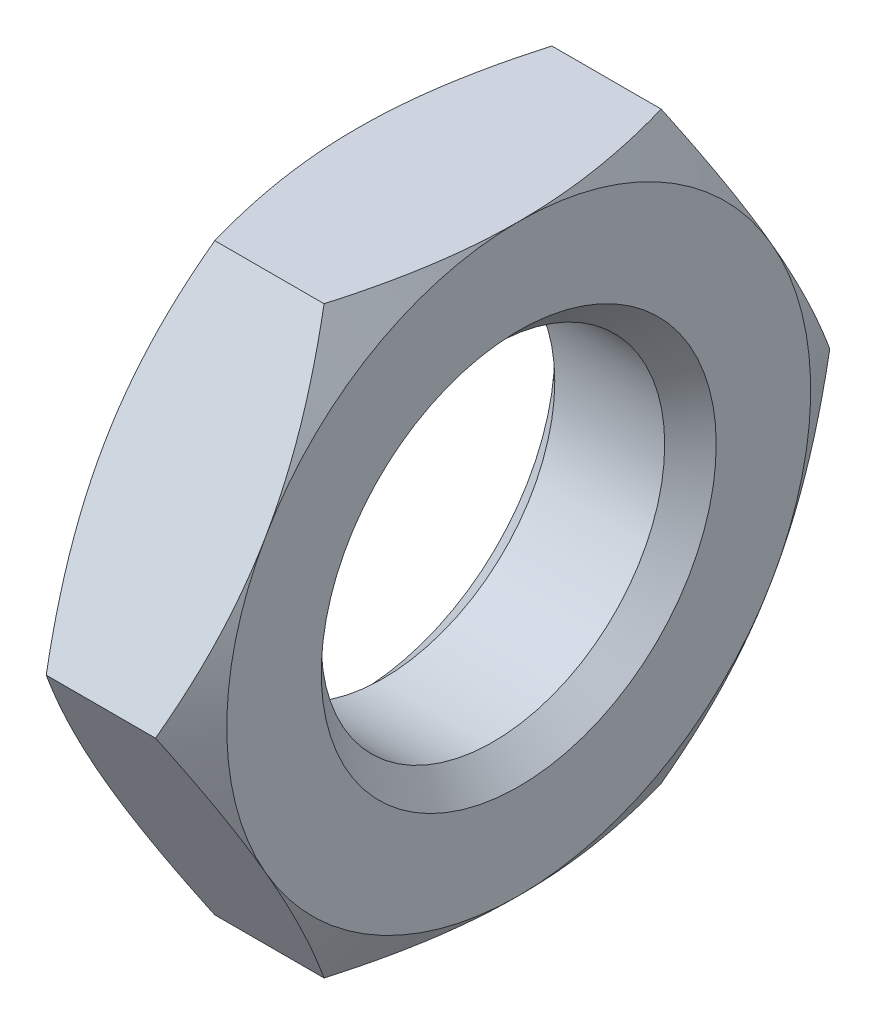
ISO-10303-21;
HEADER;
FILE_DESCRIPTION(('STEP AP214'),'2;1');
FILE_NAME('part.step','',(''),(''),'','','');
FILE_SCHEMA(('AUTOMOTIVE_DESIGN { 1 0 10303 214 1 1 1 1 }'));
ENDSEC;
DATA;
#1=APPLICATION_CONTEXT('core data for automotive mechanical design processes');
#2=APPLICATION_PROTOCOL_DEFINITION('international standard','automotive_design',2000,#1);
#3=PRODUCT_CONTEXT('',#1,'mechanical');
#4=PRODUCT('Part','Part','',(#3));
#5=PRODUCT_RELATED_PRODUCT_CATEGORY('part','',(#4));
#6=PRODUCT_DEFINITION_FORMATION('','',#4);
#7=PRODUCT_DEFINITION_CONTEXT('part definition',#1,'design');
#8=PRODUCT_DEFINITION('design','',#6,#7);
#9=PRODUCT_DEFINITION_SHAPE('','',#8);
#10=(LENGTH_UNIT() NAMED_UNIT(*) SI_UNIT(.MILLI.,.METRE.));
#11=(NAMED_UNIT(*) PLANE_ANGLE_UNIT() SI_UNIT($,.RADIAN.));
#12=(NAMED_UNIT(*) SI_UNIT($,.STERADIAN.) SOLID_ANGLE_UNIT());
#13=UNCERTAINTY_MEASURE_WITH_UNIT(LENGTH_MEASURE(1.E-05),#10,'distance_accuracy_value','');
#14=(GEOMETRIC_REPRESENTATION_CONTEXT(3) GLOBAL_UNCERTAINTY_ASSIGNED_CONTEXT((#13)) GLOBAL_UNIT_ASSIGNED_CONTEXT((#10,
#11,#12)) REPRESENTATION_CONTEXT('',''));
#15=CARTESIAN_POINT('',(0.,0.,0.));
#16=DIRECTION('',(0.,0.,1.));
#17=DIRECTION('',(1.,0.,0.));
#18=AXIS2_PLACEMENT_3D('',#15,#16,#17);
#19=CARTESIAN_POINT('',(4.7,8.5,-4.90747728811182));
#20=DIRECTION('',(1.,0.,0.));
#21=DIRECTION('',(0.,0.,-1.));
#22=AXIS2_PLACEMENT_3D('',#19,#20,#21);
#23=PLANE('',#22);
#24=CARTESIAN_POINT('',(4.7,0.,0.));
#25=DIRECTION('',(1.,0.,0.));
#26=DIRECTION('',(0.,0.,-1.));
#27=AXIS2_PLACEMENT_3D('',#24,#25,#26);
#28=CIRCLE('',#27,5.75000000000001);
#29=CARTESIAN_POINT('',(4.7,0.,-5.75000000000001));
#30=VERTEX_POINT('',#29);
#31=EDGE_CURVE('E11',#30,#30,#28,.F.);
#32=ORIENTED_EDGE('',*,*,#31,.T.);
#33=EDGE_LOOP('',(#32));
#34=FACE_BOUND('',#33,.T.);
#35=CARTESIAN_POINT('',(4.7,0.,0.));
#36=DIRECTION('',(1.,0.,0.));
#37=DIRECTION('',(0.,0.,-1.));
#38=AXIS2_PLACEMENT_3D('',#35,#36,#37);
#39=CIRCLE('',#38,8.5);
#40=CARTESIAN_POINT('',(4.7,-8.5,0.));
#41=VERTEX_POINT('',#40);
#42=CARTESIAN_POINT('',(4.7,-4.25,-7.36121593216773));
#43=VERTEX_POINT('',#42);
#44=EDGE_CURVE('E142',#41,#43,#39,.T.);
#45=ORIENTED_EDGE('',*,*,#44,.T.);
#46=CARTESIAN_POINT('',(4.7,4.25,-7.36121593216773));
#47=VERTEX_POINT('',#46);
#48=EDGE_CURVE('E130',#43,#47,#39,.T.);
#49=ORIENTED_EDGE('',*,*,#48,.T.);
#50=CARTESIAN_POINT('',(4.7,8.5,0.));
#51=VERTEX_POINT('',#50);
#52=EDGE_CURVE('E144',#47,#51,#39,.T.);
#53=ORIENTED_EDGE('',*,*,#52,.T.);
#54=CARTESIAN_POINT('',(4.7,4.25,7.36121593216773));
#55=VERTEX_POINT('',#54);
#56=EDGE_CURVE('E55',#51,#55,#39,.T.);
#57=ORIENTED_EDGE('',*,*,#56,.T.);
#58=CARTESIAN_POINT('',(4.7,-4.25,7.36121593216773));
#59=VERTEX_POINT('',#58);
#60=EDGE_CURVE('E63',#55,#59,#39,.T.);
#61=ORIENTED_EDGE('',*,*,#60,.T.);
#62=EDGE_CURVE('E166',#59,#41,#39,.T.);
#63=ORIENTED_EDGE('',*,*,#62,.T.);
#64=EDGE_LOOP('',(#45,#49,#53,#57,#61,#63));
#65=FACE_BOUND('',#64,.T.);
#66=ADVANCED_FACE('F39',(#34,#65),#23,.T.);
#67=CARTESIAN_POINT('',(0.,8.5,-4.90747728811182));
#68=DIRECTION('',(1.,0.,0.));
#69=DIRECTION('',(0.,0.,-1.));
#70=AXIS2_PLACEMENT_3D('',#67,#68,#69);
#71=PLANE('',#70);
#72=CARTESIAN_POINT('',(0.,0.,0.));
#73=DIRECTION('',(1.,0.,0.));
#74=DIRECTION('',(0.,0.,-1.));
#75=AXIS2_PLACEMENT_3D('',#72,#73,#74);
#76=CIRCLE('',#75,5.75);
#77=CARTESIAN_POINT('',(0.,0.,-5.75));
#78=VERTEX_POINT('',#77);
#79=EDGE_CURVE('E164',#78,#78,#76,.T.);
#80=ORIENTED_EDGE('',*,*,#79,.T.);
#81=EDGE_LOOP('',(#80));
#82=FACE_BOUND('',#81,.T.);
#83=CARTESIAN_POINT('',(0.,0.,0.));
#84=DIRECTION('',(1.,0.,0.));
#85=DIRECTION('',(0.,0.,-1.));
#86=AXIS2_PLACEMENT_3D('',#83,#84,#85);
#87=CIRCLE('',#86,8.5);
#88=CARTESIAN_POINT('',(0.,-4.25,-7.36121593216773));
#89=VERTEX_POINT('',#88);
#90=CARTESIAN_POINT('',(0.,4.25,-7.36121593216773));
#91=VERTEX_POINT('',#90);
#92=EDGE_CURVE('E173',#89,#91,#87,.T.);
#93=ORIENTED_EDGE('',*,*,#92,.F.);
#94=CARTESIAN_POINT('',(0.,-8.5,0.));
#95=VERTEX_POINT('',#94);
#96=EDGE_CURVE('E318',#95,#89,#87,.T.);
#97=ORIENTED_EDGE('',*,*,#96,.F.);
#98=CARTESIAN_POINT('',(0.,-4.25,7.36121593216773));
#99=VERTEX_POINT('',#98);
#100=EDGE_CURVE('E321',#99,#95,#87,.T.);
#101=ORIENTED_EDGE('',*,*,#100,.F.);
#102=CARTESIAN_POINT('',(0.,4.25,7.36121593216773));
#103=VERTEX_POINT('',#102);
#104=EDGE_CURVE('E328',#103,#99,#87,.T.);
#105=ORIENTED_EDGE('',*,*,#104,.F.);
#106=CARTESIAN_POINT('',(0.,8.5,0.));
#107=VERTEX_POINT('',#106);
#108=EDGE_CURVE('E178',#107,#103,#87,.T.);
#109=ORIENTED_EDGE('',*,*,#108,.F.);
#110=EDGE_CURVE('E174',#91,#107,#87,.T.);
#111=ORIENTED_EDGE('',*,*,#110,.F.);
#112=EDGE_LOOP('',(#93,#97,#101,#105,#109,#111));
#113=FACE_BOUND('',#112,.T.);
#114=ADVANCED_FACE('F319',(#82,#113),#71,.F.);
#115=CARTESIAN_POINT('',(4.7,0.,0.));
#116=DIRECTION('',(-1.,0.,0.));
#117=DIRECTION('',(0.,0.,1.));
#118=AXIS2_PLACEMENT_3D('',#115,#116,#117);
#119=CYLINDRICAL_SURFACE('',#118,5.);
#120=CARTESIAN_POINT('',(0.750000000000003,0.,0.));
#121=DIRECTION('',(1.,0.,0.));
#122=DIRECTION('',(0.,0.,-1.));
#123=AXIS2_PLACEMENT_3D('',#120,#121,#122);
#124=CIRCLE('',#123,5.);
#125=CARTESIAN_POINT('',(0.750000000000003,0.,-5.));
#126=VERTEX_POINT('',#125);
#127=EDGE_CURVE('E48',#126,#126,#124,.F.);
#128=ORIENTED_EDGE('',*,*,#127,.T.);
#129=EDGE_LOOP('',(#128));
#130=FACE_BOUND('',#129,.T.);
#131=CARTESIAN_POINT('',(3.95,0.,0.));
#132=DIRECTION('',(1.,0.,0.));
#133=DIRECTION('',(0.,0.,-1.));
#134=AXIS2_PLACEMENT_3D('',#131,#132,#133);
#135=CIRCLE('',#134,5.);
#136=CARTESIAN_POINT('',(3.95,0.,-5.));
#137=VERTEX_POINT('',#136);
#138=EDGE_CURVE('E391',#137,#137,#135,.T.);
#139=ORIENTED_EDGE('',*,*,#138,.T.);
#140=EDGE_LOOP('',(#139));
#141=FACE_BOUND('',#140,.T.);
#142=ADVANCED_FACE('F234',(#130,#141),#119,.F.);
#143=CARTESIAN_POINT('',(0.,0.,0.));
#144=DIRECTION('',(1.,0.,0.));
#145=DIRECTION('',(0.,0.,-1.));
#146=AXIS2_PLACEMENT_3D('',#143,#144,#145);
#147=CONICAL_SURFACE('',#146,8.5,1.0471975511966);
#148=CARTESIAN_POINT('',(0.759256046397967,-8.5002,-4.90736181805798));
#149=CARTESIAN_POINT('',(0.696986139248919,-8.31336077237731,-5.01523349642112));
#150=CARTESIAN_POINT('',(0.637542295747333,-8.1258249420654,-5.1235073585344));
#151=CARTESIAN_POINT('',(0.52508511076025,-7.74923024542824,-5.34093440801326));
#152=CARTESIAN_POINT('',(0.472074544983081,-7.56017075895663,-5.45008795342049));
#153=CARTESIAN_POINT('',(0.323733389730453,-6.9899652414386,-5.77929626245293));
#154=CARTESIAN_POINT('',(0.239358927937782,-6.60656835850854,-6.00065055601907));
#155=CARTESIAN_POINT('',(0.140420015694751,-6.03282233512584,-6.33190297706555));
#156=CARTESIAN_POINT('',(0.112235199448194,-5.84418723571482,-6.44081150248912));
#157=CARTESIAN_POINT('',(0.0649740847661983,-5.46606397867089,-6.65912106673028));
#158=CARTESIAN_POINT('',(0.0458969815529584,-5.27657589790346,-6.76852206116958));
#159=CARTESIAN_POINT('',(0.0173347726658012,-4.8972734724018,-6.98751241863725));
#160=CARTESIAN_POINT('',(0.00783878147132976,-4.70745974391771,-7.09710142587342));
#161=CARTESIAN_POINT('',(-0.0013576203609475,-4.32765694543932,-7.3163806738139));
#162=CARTESIAN_POINT('',(-0.00105833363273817,-4.13766788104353,-7.42607091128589));
#163=CARTESIAN_POINT('',(0.00865447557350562,-3.78247698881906,-7.63114046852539));
#164=CARTESIAN_POINT('',(0.0168831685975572,-3.6172500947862,-7.72653426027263));
#165=CARTESIAN_POINT('',(0.0405892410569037,-3.28718328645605,-7.9170984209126));
#166=CARTESIAN_POINT('',(0.0560671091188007,-3.12234339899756,-8.01226877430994));
#167=CARTESIAN_POINT('',(0.11300862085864,-2.62846189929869,-8.29741139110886));
#168=CARTESIAN_POINT('',(0.164973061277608,-2.30029449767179,-8.48687892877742));
#169=CARTESIAN_POINT('',(0.294884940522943,-1.64047857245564,-8.86782383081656));
#170=CARTESIAN_POINT('',(0.373383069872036,-1.30891425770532,-9.05925257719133));
#171=CARTESIAN_POINT('',(0.551541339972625,-0.650730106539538,-9.43925537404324));
#172=CARTESIAN_POINT('',(0.651159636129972,-0.324101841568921,-9.62783429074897));
#173=CARTESIAN_POINT('',(0.759256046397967,0.000199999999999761,-9.81507004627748));
#174=B_SPLINE_CURVE_WITH_KNOTS('',3,(#148,#149,#150,#151,#152,#153,#154,#155,#156,#157,#158,
#159,#160,#161,#162,#163,#164,#165,#166,#167,#168,#169,#170,#171,#172,#173),.UNSPECIFIED.,.F.,
.F.,(4,2,2,2,2,2,2,2,2,2,2,2,4),(0.,0.673596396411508,1.34748239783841,2.69805431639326,
3.356799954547,4.01548737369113,4.67342558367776,5.33134346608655,5.90409556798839,
6.47688628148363,7.62328361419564,8.79510569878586,9.9646274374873),.UNSPECIFIED.);
#175=CARTESIAN_POINT('',(0.759189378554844,0.,-9.81495457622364));
#176=VERTEX_POINT('',#175);
#177=EDGE_CURVE('E336',#89,#176,#174,.T.);
#178=ORIENTED_EDGE('',*,*,#177,.F.);
#179=ORIENTED_EDGE('',*,*,#92,.T.);
#180=CARTESIAN_POINT('',(0.759256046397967,-0.00020000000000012,-9.81507004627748));
#181=CARTESIAN_POINT('',(0.69698613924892,0.186639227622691,-9.70719836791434));
#182=CARTESIAN_POINT('',(0.637542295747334,0.374175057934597,-9.59892450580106));
#183=CARTESIAN_POINT('',(0.52508511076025,0.750769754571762,-9.3814974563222));
#184=CARTESIAN_POINT('',(0.472074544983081,0.939829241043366,-9.27234391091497));
#185=CARTESIAN_POINT('',(0.323733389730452,1.5100347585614,-8.94313560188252));
#186=CARTESIAN_POINT('',(0.23935892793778,1.89343164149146,-8.72178130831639));
#187=CARTESIAN_POINT('',(0.14042001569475,2.46717766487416,-8.39052888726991));
#188=CARTESIAN_POINT('',(0.112235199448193,2.65581276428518,-8.28162036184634));
#189=CARTESIAN_POINT('',(0.0649740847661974,3.03393602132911,-8.06331079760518));
#190=CARTESIAN_POINT('',(0.0458969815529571,3.22342410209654,-7.95390980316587));
#191=CARTESIAN_POINT('',(0.0173347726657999,3.6027265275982,-7.73491944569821));
#192=CARTESIAN_POINT('',(0.00783878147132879,3.79254025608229,-7.62533043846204));
#193=CARTESIAN_POINT('',(-0.00135762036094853,4.17234305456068,-7.40605119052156));
#194=CARTESIAN_POINT('',(-0.00105833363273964,4.36233211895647,-7.29636095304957));
#195=CARTESIAN_POINT('',(0.00865447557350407,4.71752301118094,-7.09129139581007));
#196=CARTESIAN_POINT('',(0.0168831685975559,4.8827499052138,-6.99589760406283));
#197=CARTESIAN_POINT('',(0.0405892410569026,5.21281671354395,-6.80533344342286));
#198=CARTESIAN_POINT('',(0.0560671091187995,5.37765660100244,-6.71016309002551));
#199=CARTESIAN_POINT('',(0.113008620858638,5.87153810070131,-6.42502047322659));
#200=CARTESIAN_POINT('',(0.164973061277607,6.19970550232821,-6.23555293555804));
#201=CARTESIAN_POINT('',(0.294884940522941,6.85952142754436,-5.8546080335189));
#202=CARTESIAN_POINT('',(0.373383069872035,7.19108574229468,-5.66317928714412));
#203=CARTESIAN_POINT('',(0.551541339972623,7.84926989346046,-5.28317649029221));
#204=CARTESIAN_POINT('',(0.65115963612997,8.17589815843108,-5.09459757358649));
#205=CARTESIAN_POINT('',(0.759256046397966,8.5002,-4.90736181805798));
#206=B_SPLINE_CURVE_WITH_KNOTS('',3,(#180,#181,#182,#183,#184,#185,#186,#187,#188,#189,#190,
#191,#192,#193,#194,#195,#196,#197,#198,#199,#200,#201,#202,#203,#204,#205),.UNSPECIFIED.,.F.,
.F.,(4,2,2,2,2,2,2,2,2,2,2,2,4),(0.,0.673596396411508,1.34748239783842,2.69805431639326,
3.356799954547,4.01548737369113,4.67342558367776,5.33134346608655,5.90409556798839,
6.47688628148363,7.62328361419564,8.79510569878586,9.9646274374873),.UNSPECIFIED.);
#207=EDGE_CURVE('E215',#176,#91,#206,.T.);
#208=ORIENTED_EDGE('',*,*,#207,.F.);
#209=EDGE_LOOP('',(#178,#179,#208));
#210=FACE_BOUND('',#209,.T.);
#211=ADVANCED_FACE('F194',(#210),#147,.T.);
#212=ORIENTED_EDGE('',*,*,#96,.T.);
#213=CARTESIAN_POINT('',(0.759189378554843,-8.5,-4.90747728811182));
#214=VERTEX_POINT('',#213);
#215=EDGE_CURVE('E156',#214,#89,#174,.T.);
#216=ORIENTED_EDGE('',*,*,#215,.F.);
#217=CARTESIAN_POINT('',(4.17503521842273,-8.5,-13.2372995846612));
#218=CARTESIAN_POINT('',(3.99450182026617,-8.5,-12.8655907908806));
#219=CARTESIAN_POINT('',(3.81568350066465,-8.5,-12.4930346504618));
#220=CARTESIAN_POINT('',(3.46244047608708,-8.5,-11.7457772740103));
#221=CARTESIAN_POINT('',(3.28801645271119,-8.5,-11.3710757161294));
#222=CARTESIAN_POINT('',(2.94365969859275,-8.5,-10.6171728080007));
#223=CARTESIAN_POINT('',(2.7737561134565,-8.5,-10.2379580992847));
#224=CARTESIAN_POINT('',(2.44082821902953,-8.5,-9.476531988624));
#225=CARTESIAN_POINT('',(2.27780358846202,-8.5,-9.09432072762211));
#226=CARTESIAN_POINT('',(1.95525512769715,-8.5,-8.31372661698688));
#227=CARTESIAN_POINT('',(1.79602021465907,-8.5,-7.91522372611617));
#228=CARTESIAN_POINT('',(1.4894686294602,-8.5,-7.11357707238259));
#229=CARTESIAN_POINT('',(1.34215328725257,-8.5,-6.71043279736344));
#230=CARTESIAN_POINT('',(1.06326825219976,-8.5,-5.89959407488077));
#231=CARTESIAN_POINT('',(0.931667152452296,-8.5,-5.49191054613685));
#232=CARTESIAN_POINT('',(0.688395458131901,-8.5,-4.67070989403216));
#233=CARTESIAN_POINT('',(0.576718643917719,-8.5,-4.25719463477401));
#234=CARTESIAN_POINT('',(0.37922515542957,-8.5,-3.42634387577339));
#235=CARTESIAN_POINT('',(0.293265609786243,-8.5,-3.0090432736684));
#236=CARTESIAN_POINT('',(0.187304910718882,-8.5,-2.3792483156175));
#237=CARTESIAN_POINT('',(0.155813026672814,-8.5,-2.16866088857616));
#238=CARTESIAN_POINT('',(0.101105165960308,-8.5,-1.7464206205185));
#239=CARTESIAN_POINT('',(0.07788838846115,-8.5,-1.53476788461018));
#240=CARTESIAN_POINT('',(0.0404873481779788,-8.5,-1.113469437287));
#241=CARTESIAN_POINT('',(0.0261882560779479,-8.5,-0.903833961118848));
#242=CARTESIAN_POINT('',(0.00647089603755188,-8.5,-0.484146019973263));
#243=CARTESIAN_POINT('',(0.0010524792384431,-8.5,-0.274093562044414));
#244=CARTESIAN_POINT('',(-0.000774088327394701,-8.5,0.146052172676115));
#245=CARTESIAN_POINT('',(0.00281776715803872,-8.5,0.356145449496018));
#246=CARTESIAN_POINT('',(0.0189231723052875,-8.5,0.775992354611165));
#247=CARTESIAN_POINT('',(0.0314371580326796,-8.5,0.985745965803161));
#248=CARTESIAN_POINT('',(0.0718333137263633,-8.5,1.48819217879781));
#249=CARTESIAN_POINT('',(0.103856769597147,-8.5,1.78055900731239));
#250=CARTESIAN_POINT('',(0.183503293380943,-8.5,2.36314504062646));
#251=CARTESIAN_POINT('',(0.231128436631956,-8.5,2.65336395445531));
#252=CARTESIAN_POINT('',(0.394883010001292,-8.5,3.52045554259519));
#253=CARTESIAN_POINT('',(0.531862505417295,-8.5,4.09344393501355));
#254=CARTESIAN_POINT('',(0.769682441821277,-8.5,4.95026142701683));
#255=CARTESIAN_POINT('',(0.855458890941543,-8.5,5.23852765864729));
#256=CARTESIAN_POINT('',(1.03599407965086,-8.5,5.81226113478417));
#257=CARTESIAN_POINT('',(1.130752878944,-8.5,6.09772836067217));
#258=CARTESIAN_POINT('',(1.32772636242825,-8.5,6.66595187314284));
#259=CARTESIAN_POINT('',(1.42993863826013,-8.5,6.94870900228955));
#260=CARTESIAN_POINT('',(1.64060919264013,-8.5,7.51187593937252));
#261=CARTESIAN_POINT('',(1.74906739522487,-8.5,7.79228577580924));
#262=CARTESIAN_POINT('',(2.0136213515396,-8.5,8.45773722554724));
#263=CARTESIAN_POINT('',(2.17208939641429,-8.5,8.84183401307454));
#264=CARTESIAN_POINT('',(2.49684442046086,-8.5,9.60671793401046));
#265=CARTESIAN_POINT('',(2.66313189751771,-8.5,9.98750485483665));
#266=CARTESIAN_POINT('',(3.00194830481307,-8.5,10.7463908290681));
#267=CARTESIAN_POINT('',(3.17447868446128,-8.5,11.1244892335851));
#268=CARTESIAN_POINT('',(3.52451168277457,-8.5,11.8783613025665));
#269=CARTESIAN_POINT('',(3.70201419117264,-8.5,12.2541350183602));
#270=CARTESIAN_POINT('',(4.06125625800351,-8.5,13.0041702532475));
#271=CARTESIAN_POINT('',(4.24300037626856,-8.5,13.3784295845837));
#272=CARTESIAN_POINT('',(4.60980783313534,-8.5,14.1253174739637));
#273=CARTESIAN_POINT('',(4.79487118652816,-8.5,14.4979460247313));
#274=CARTESIAN_POINT('',(5.3541015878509,-8.5,15.6136782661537));
#275=CARTESIAN_POINT('',(5.73235875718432,-8.5,16.35473160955));
#276=CARTESIAN_POINT('',(6.46405178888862,-8.5,17.7700610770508));
#277=CARTESIAN_POINT('',(6.81686536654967,-8.5,18.4446603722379));
#278=CARTESIAN_POINT('',(7.52731870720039,-8.5,19.7913428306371));
#279=CARTESIAN_POINT('',(7.88495864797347,-8.5,20.4634258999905));
#280=CARTESIAN_POINT('',(8.60298478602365,-8.5,21.8039058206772));
#281=CARTESIAN_POINT('',(8.96336160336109,-8.5,22.4723077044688));
#282=CARTESIAN_POINT('',(9.68699043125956,-8.5,23.8075047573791));
#283=CARTESIAN_POINT('',(10.0502422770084,-8.5,24.4743000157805));
#284=CARTESIAN_POINT('',(10.4145657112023,-8.5,25.1405052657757));
#285=B_SPLINE_CURVE_WITH_KNOTS('',3,(#217,#218,#219,#220,#221,#222,#223,#224,#225,#226,#227,
#228,#229,#230,#231,#232,#233,#234,#235,#236,#237,#238,#239,#240,#241,#242,#243,#244,#245,#246,
#247,#248,#249,#250,#251,#252,#253,#254,#255,#256,#257,#258,#259,#260,#261,#262,#263,#264,#265,
#266,#267,#268,#269,#270,#271,#272,#273,#274,#275,#276,#277,#278,#279,#280,#281,#282,#283,#284),
.UNSPECIFIED.,.F.,.F.,(4,2,2,2,2,2,2,2,2,2,2,2,2,2,2,2,2,2,2,2,2,2,2,2,2,2,2,2,2,2,2,2,2,4),(0.,
1.23970741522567,2.47960595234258,3.72616226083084,4.97266028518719,6.25992938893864,
7.54734192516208,8.83213673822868,10.116529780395,11.393648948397,12.0322992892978,
12.6708878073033,13.3010738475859,13.9312493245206,14.5614252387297,15.1916319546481,
16.0734809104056,16.9554472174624,18.7203368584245,19.6225326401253,20.524734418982,
21.4266459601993,22.3285465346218,23.5749372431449,24.8214074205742,26.0681688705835,
27.3149026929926,28.5630448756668,29.8111926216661,32.3071447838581,34.5909923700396,
36.8749243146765,39.153006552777,41.4309591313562),.UNSPECIFIED.);
#286=EDGE_CURVE('E177',#95,#214,#285,.F.);
#287=ORIENTED_EDGE('',*,*,#286,.F.);
#288=EDGE_LOOP('',(#212,#216,#287));
#289=FACE_BOUND('',#288,.T.);
#290=ADVANCED_FACE('F353',(#289),#147,.T.);
#291=CARTESIAN_POINT('',(2.35,0.,0.));
#292=DIRECTION('',(-1.,0.,0.));
#293=DIRECTION('',(0.,0.,1.));
#294=AXIS2_PLACEMENT_3D('',#291,#292,#293);
#295=CONICAL_SURFACE('',#294,12.5703193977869,1.0471975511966);
#296=CARTESIAN_POINT('',(3.94074395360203,0.000199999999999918,-9.81507004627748));
#297=CARTESIAN_POINT('',(4.00301386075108,-0.18663922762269,-9.70719836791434));
#298=CARTESIAN_POINT('',(4.06245770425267,-0.374175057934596,-9.59892450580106));
#299=CARTESIAN_POINT('',(4.17491488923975,-0.750769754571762,-9.3814974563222));
#300=CARTESIAN_POINT('',(4.22792545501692,-0.939829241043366,-9.27234391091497));
#301=CARTESIAN_POINT('',(4.37626661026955,-1.5100347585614,-8.94313560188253));
#302=CARTESIAN_POINT('',(4.46064107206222,-1.89343164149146,-8.72178130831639));
#303=CARTESIAN_POINT('',(4.55957998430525,-2.46717766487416,-8.39052888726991));
#304=CARTESIAN_POINT('',(4.58776480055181,-2.65581276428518,-8.28162036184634));
#305=CARTESIAN_POINT('',(4.6350259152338,-3.03393602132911,-8.06331079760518));
#306=CARTESIAN_POINT('',(4.65410301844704,-3.22342410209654,-7.95390980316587));
#307=CARTESIAN_POINT('',(4.6826652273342,-3.6027265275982,-7.73491944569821));
#308=CARTESIAN_POINT('',(4.69216121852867,-3.79254025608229,-7.62533043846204));
#309=CARTESIAN_POINT('',(4.70135762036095,-4.17234305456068,-7.40605119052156));
#310=CARTESIAN_POINT('',(4.70105833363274,-4.36233211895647,-7.29636095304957));
#311=CARTESIAN_POINT('',(4.6913455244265,-4.71752301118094,-7.09129139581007));
#312=CARTESIAN_POINT('',(4.68311683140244,-4.8827499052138,-6.99589760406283));
#313=CARTESIAN_POINT('',(4.6594107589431,-5.21281671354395,-6.80533344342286));
#314=CARTESIAN_POINT('',(4.6439328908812,-5.37765660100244,-6.71016309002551));
#315=CARTESIAN_POINT('',(4.58699137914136,-5.87153810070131,-6.42502047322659));
#316=CARTESIAN_POINT('',(4.53502693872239,-6.19970550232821,-6.23555293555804));
#317=CARTESIAN_POINT('',(4.40511505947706,-6.85952142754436,-5.8546080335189));
#318=CARTESIAN_POINT('',(4.32661693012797,-7.19108574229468,-5.66317928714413));
#319=CARTESIAN_POINT('',(4.14845866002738,-7.84926989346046,-5.28317649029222));
#320=CARTESIAN_POINT('',(4.04884036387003,-8.17589815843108,-5.09459757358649));
#321=CARTESIAN_POINT('',(3.94074395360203,-8.5002,-4.90736181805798));
#322=B_SPLINE_CURVE_WITH_KNOTS('',3,(#296,#297,#298,#299,#300,#301,#302,#303,#304,#305,#306,
#307,#308,#309,#310,#311,#312,#313,#314,#315,#316,#317,#318,#319,#320,#321),.UNSPECIFIED.,.F.,
.F.,(4,2,2,2,2,2,2,2,2,2,2,2,4),(0.,0.673596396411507,1.34748239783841,2.69805431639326,
3.356799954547,4.01548737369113,4.67342558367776,5.33134346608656,5.90409556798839,
6.47688628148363,7.62328361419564,8.79510569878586,9.9646274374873),.UNSPECIFIED.);
#323=CARTESIAN_POINT('',(3.94081062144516,-8.5,-4.90747728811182));
#324=VERTEX_POINT('',#323);
#325=EDGE_CURVE('E147',#43,#324,#322,.T.);
#326=ORIENTED_EDGE('',*,*,#325,.F.);
#327=ORIENTED_EDGE('',*,*,#44,.F.);
#328=CARTESIAN_POINT('',(0.524964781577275,-8.5,-13.2372995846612));
#329=CARTESIAN_POINT('',(0.705498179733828,-8.5,-12.8655907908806));
#330=CARTESIAN_POINT('',(0.884316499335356,-8.5,-12.4930346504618));
#331=CARTESIAN_POINT('',(1.23755952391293,-8.5,-11.7457772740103));
#332=CARTESIAN_POINT('',(1.41198354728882,-8.5,-11.3710757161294));
#333=CARTESIAN_POINT('',(1.75634030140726,-8.5,-10.6171728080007));
#334=CARTESIAN_POINT('',(1.92624388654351,-8.5,-10.2379580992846));
#335=CARTESIAN_POINT('',(2.25917178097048,-8.5,-9.47653198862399));
#336=CARTESIAN_POINT('',(2.42219641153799,-8.5,-9.09432072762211));
#337=CARTESIAN_POINT('',(2.74474487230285,-8.5,-8.31372661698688));
#338=CARTESIAN_POINT('',(2.90397978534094,-8.5,-7.91522372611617));
#339=CARTESIAN_POINT('',(3.2105313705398,-8.5,-7.11357707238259));
#340=CARTESIAN_POINT('',(3.35784671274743,-8.5,-6.71043279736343));
#341=CARTESIAN_POINT('',(3.63673174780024,-8.5,-5.89959407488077));
#342=CARTESIAN_POINT('',(3.7683328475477,-8.5,-5.49191054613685));
#343=CARTESIAN_POINT('',(4.0116045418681,-8.5,-4.67070989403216));
#344=CARTESIAN_POINT('',(4.12328135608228,-8.5,-4.25719463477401));
#345=CARTESIAN_POINT('',(4.32077484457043,-8.5,-3.42634387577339));
#346=CARTESIAN_POINT('',(4.40673439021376,-8.5,-3.0090432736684));
#347=CARTESIAN_POINT('',(4.51269508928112,-8.5,-2.37924831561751));
#348=CARTESIAN_POINT('',(4.54418697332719,-8.5,-2.16866088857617));
#349=CARTESIAN_POINT('',(4.59889483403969,-8.5,-1.7464206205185));
#350=CARTESIAN_POINT('',(4.62211161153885,-8.5,-1.53476788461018));
#351=CARTESIAN_POINT('',(4.65951265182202,-8.5,-1.11346943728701));
#352=CARTESIAN_POINT('',(4.67381174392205,-8.5,-0.903833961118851));
#353=CARTESIAN_POINT('',(4.69352910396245,-8.5,-0.484146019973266));
#354=CARTESIAN_POINT('',(4.69894752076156,-8.5,-0.274093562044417));
#355=CARTESIAN_POINT('',(4.7007740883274,-8.5,0.146052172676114));
#356=CARTESIAN_POINT('',(4.69718223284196,-8.5,0.356145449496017));
#357=CARTESIAN_POINT('',(4.68107682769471,-8.5,0.775992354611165));
#358=CARTESIAN_POINT('',(4.66856284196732,-8.5,0.98574596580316));
#359=CARTESIAN_POINT('',(4.62816668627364,-8.5,1.48819217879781));
#360=CARTESIAN_POINT('',(4.59614323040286,-8.5,1.78055900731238));
#361=CARTESIAN_POINT('',(4.51649670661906,-8.5,2.36314504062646));
#362=CARTESIAN_POINT('',(4.46887156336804,-8.5,2.65336395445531));
#363=CARTESIAN_POINT('',(4.30511698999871,-8.5,3.52045554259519));
#364=CARTESIAN_POINT('',(4.16813749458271,-8.5,4.09344393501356));
#365=CARTESIAN_POINT('',(3.93031755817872,-8.5,4.95026142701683));
#366=CARTESIAN_POINT('',(3.84454110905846,-8.5,5.2385276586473));
#367=CARTESIAN_POINT('',(3.66400592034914,-8.5,5.81226113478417));
#368=CARTESIAN_POINT('',(3.569247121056,-8.5,6.09772836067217));
#369=CARTESIAN_POINT('',(3.37227363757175,-8.5,6.66595187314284));
#370=CARTESIAN_POINT('',(3.27006136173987,-8.5,6.94870900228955));
#371=CARTESIAN_POINT('',(3.05939080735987,-8.5,7.51187593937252));
#372=CARTESIAN_POINT('',(2.95093260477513,-8.5,7.79228577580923));
#373=CARTESIAN_POINT('',(2.6863786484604,-8.5,8.45773722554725));
#374=CARTESIAN_POINT('',(2.52791060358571,-8.5,8.84183401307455));
#375=CARTESIAN_POINT('',(2.20315557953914,-8.5,9.60671793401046));
#376=CARTESIAN_POINT('',(2.03686810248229,-8.5,9.98750485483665));
#377=CARTESIAN_POINT('',(1.69805169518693,-8.5,10.7463908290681));
#378=CARTESIAN_POINT('',(1.52552131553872,-8.5,11.1244892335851));
#379=CARTESIAN_POINT('',(1.17548831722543,-8.5,11.8783613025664));
#380=CARTESIAN_POINT('',(0.997985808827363,-8.5,12.2541350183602));
#381=CARTESIAN_POINT('',(0.638743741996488,-8.5,13.0041702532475));
#382=CARTESIAN_POINT('',(0.45699962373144,-8.5,13.3784295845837));
#383=CARTESIAN_POINT('',(0.0901921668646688,-8.5,14.1253174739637));
#384=CARTESIAN_POINT('',(-0.0948711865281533,-8.5,14.4979460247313));
#385=CARTESIAN_POINT('',(-0.654101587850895,-8.5,15.6136782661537));
#386=CARTESIAN_POINT('',(-1.03235875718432,-8.5,16.35473160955));
#387=CARTESIAN_POINT('',(-1.76405178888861,-8.5,17.7700610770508));
#388=CARTESIAN_POINT('',(-2.11686536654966,-8.5,18.4446603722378));
#389=CARTESIAN_POINT('',(-2.82731870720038,-8.5,19.7913428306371));
#390=CARTESIAN_POINT('',(-3.18495864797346,-8.5,20.4634258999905));
#391=CARTESIAN_POINT('',(-3.90298478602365,-8.5,21.8039058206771));
#392=CARTESIAN_POINT('',(-4.26336160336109,-8.5,22.4723077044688));
#393=CARTESIAN_POINT('',(-4.98699043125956,-8.5,23.8075047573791));
#394=CARTESIAN_POINT('',(-5.35024227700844,-8.5,24.4743000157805));
#395=CARTESIAN_POINT('',(-5.71456571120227,-8.5,25.1405052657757));
#396=B_SPLINE_CURVE_WITH_KNOTS('',3,(#328,#329,#330,#331,#332,#333,#334,#335,#336,#337,#338,
#339,#340,#341,#342,#343,#344,#345,#346,#347,#348,#349,#350,#351,#352,#353,#354,#355,#356,#357,
#358,#359,#360,#361,#362,#363,#364,#365,#366,#367,#368,#369,#370,#371,#372,#373,#374,#375,#376,
#377,#378,#379,#380,#381,#382,#383,#384,#385,#386,#387,#388,#389,#390,#391,#392,#393,#394,#395),
.UNSPECIFIED.,.F.,.F.,(4,2,2,2,2,2,2,2,2,2,2,2,2,2,2,2,2,2,2,2,2,2,2,2,2,2,2,2,2,2,2,2,2,4),(0.,
1.23970741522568,2.47960595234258,3.72616226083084,4.97266028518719,6.25992938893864,
7.54734192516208,8.83213673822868,10.116529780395,11.393648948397,12.0322992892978,
12.6708878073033,13.3010738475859,13.9312493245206,14.5614252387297,15.1916319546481,
16.0734809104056,16.9554472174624,18.7203368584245,19.6225326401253,20.524734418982,
21.4266459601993,22.3285465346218,23.5749372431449,24.8214074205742,26.0681688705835,
27.3149026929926,28.5630448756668,29.811192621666,32.3071447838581,34.5909923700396,
36.8749243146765,39.153006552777,41.4309591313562),.UNSPECIFIED.);
#397=EDGE_CURVE('E151',#324,#41,#396,.T.);
#398=ORIENTED_EDGE('',*,*,#397,.F.);
#399=EDGE_LOOP('',(#326,#327,#398));
#400=FACE_BOUND('',#399,.T.);
#401=ADVANCED_FACE('F148',(#400),#295,.T.);
#402=ORIENTED_EDGE('',*,*,#48,.F.);
#403=CARTESIAN_POINT('',(3.94081062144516,0.,-9.81495457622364));
#404=VERTEX_POINT('',#403);
#405=EDGE_CURVE('E134',#404,#43,#322,.T.);
#406=ORIENTED_EDGE('',*,*,#405,.F.);
#407=CARTESIAN_POINT('',(3.94074395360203,8.5002,-4.90736181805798));
#408=CARTESIAN_POINT('',(4.00301386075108,8.31336077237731,-5.01523349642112));
#409=CARTESIAN_POINT('',(4.06245770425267,8.1258249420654,-5.1235073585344));
#410=CARTESIAN_POINT('',(4.17491488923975,7.74923024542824,-5.34093440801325));
#411=CARTESIAN_POINT('',(4.22792545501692,7.56017075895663,-5.45008795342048));
#412=CARTESIAN_POINT('',(4.37626661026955,6.9899652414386,-5.77929626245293));
#413=CARTESIAN_POINT('',(4.46064107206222,6.60656835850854,-6.00065055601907));
#414=CARTESIAN_POINT('',(4.55957998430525,6.03282233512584,-6.33190297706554));
#415=CARTESIAN_POINT('',(4.58776480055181,5.84418723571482,-6.44081150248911));
#416=CARTESIAN_POINT('',(4.6350259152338,5.46606397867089,-6.65912106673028));
#417=CARTESIAN_POINT('',(4.65410301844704,5.27657589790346,-6.76852206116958));
#418=CARTESIAN_POINT('',(4.6826652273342,4.8972734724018,-6.98751241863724));
#419=CARTESIAN_POINT('',(4.69216121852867,4.70745974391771,-7.09710142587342));
#420=CARTESIAN_POINT('',(4.70135762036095,4.32765694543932,-7.31638067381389));
#421=CARTESIAN_POINT('',(4.70105833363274,4.13766788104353,-7.42607091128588));
#422=CARTESIAN_POINT('',(4.6913455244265,3.78247698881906,-7.63114046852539));
#423=CARTESIAN_POINT('',(4.68311683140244,3.6172500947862,-7.72653426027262));
#424=CARTESIAN_POINT('',(4.6594107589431,3.28718328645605,-7.9170984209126));
#425=CARTESIAN_POINT('',(4.6439328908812,3.12234339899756,-8.01226877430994));
#426=CARTESIAN_POINT('',(4.58699137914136,2.62846189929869,-8.29741139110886));
#427=CARTESIAN_POINT('',(4.53502693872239,2.30029449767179,-8.48687892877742));
#428=CARTESIAN_POINT('',(4.40511505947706,1.64047857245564,-8.86782383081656));
#429=CARTESIAN_POINT('',(4.32661693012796,1.30891425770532,-9.05925257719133));
#430=CARTESIAN_POINT('',(4.14845866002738,0.650730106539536,-9.43925537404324));
#431=CARTESIAN_POINT('',(4.04884036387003,0.32410184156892,-9.62783429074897));
#432=CARTESIAN_POINT('',(3.94074395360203,-0.000200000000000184,-9.81507004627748));
#433=B_SPLINE_CURVE_WITH_KNOTS('',3,(#407,#408,#409,#410,#411,#412,#413,#414,#415,#416,#417,
#418,#419,#420,#421,#422,#423,#424,#425,#426,#427,#428,#429,#430,#431,#432),.UNSPECIFIED.,.F.,
.F.,(4,2,2,2,2,2,2,2,2,2,2,2,4),(0.,0.673596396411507,1.34748239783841,2.69805431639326,
3.356799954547,4.01548737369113,4.67342558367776,5.33134346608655,5.90409556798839,
6.47688628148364,7.62328361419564,8.79510569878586,9.9646274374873),.UNSPECIFIED.);
#434=EDGE_CURVE('E136',#47,#404,#433,.T.);
#435=ORIENTED_EDGE('',*,*,#434,.F.);
#436=EDGE_LOOP('',(#402,#406,#435));
#437=FACE_BOUND('',#436,.T.);
#438=ADVANCED_FACE('F132',(#437),#295,.T.);
#439=ORIENTED_EDGE('',*,*,#100,.T.);
#440=CARTESIAN_POINT('',(0.759189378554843,-8.5,4.90747728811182));
#441=VERTEX_POINT('',#440);
#442=EDGE_CURVE('E187',#441,#95,#285,.F.);
#443=ORIENTED_EDGE('',*,*,#442,.F.);
#444=CARTESIAN_POINT('',(0.759256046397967,0.000200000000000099,9.81507004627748));
#445=CARTESIAN_POINT('',(0.69698613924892,-0.186639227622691,9.70719836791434));
#446=CARTESIAN_POINT('',(0.637542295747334,-0.374175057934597,9.59892450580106));
#447=CARTESIAN_POINT('',(0.52508511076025,-0.750769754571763,9.3814974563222));
#448=CARTESIAN_POINT('',(0.47207454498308,-0.939829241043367,9.27234391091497));
#449=CARTESIAN_POINT('',(0.323733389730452,-1.5100347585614,8.94313560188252));
#450=CARTESIAN_POINT('',(0.239358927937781,-1.89343164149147,8.72178130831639));
#451=CARTESIAN_POINT('',(0.14042001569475,-2.46717766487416,8.39052888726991));
#452=CARTESIAN_POINT('',(0.112235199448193,-2.65581276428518,8.28162036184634));
#453=CARTESIAN_POINT('',(0.0649740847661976,-3.03393602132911,8.06331079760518));
#454=CARTESIAN_POINT('',(0.0458969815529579,-3.22342410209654,7.95390980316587));
#455=CARTESIAN_POINT('',(0.0173347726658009,-3.6027265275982,7.73491944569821));
#456=CARTESIAN_POINT('',(0.00783878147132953,-3.79254025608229,7.62533043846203));
#457=CARTESIAN_POINT('',(-0.00135762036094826,-4.17234305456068,7.40605119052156));
#458=CARTESIAN_POINT('',(-0.00105833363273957,-4.36233211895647,7.29636095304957));
#459=CARTESIAN_POINT('',(0.00865447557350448,-4.71752301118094,7.09129139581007));
#460=CARTESIAN_POINT('',(0.0168831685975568,-4.8827499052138,6.99589760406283));
#461=CARTESIAN_POINT('',(0.0405892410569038,-5.21281671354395,6.80533344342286));
#462=CARTESIAN_POINT('',(0.0560671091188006,-5.37765660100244,6.71016309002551));
#463=CARTESIAN_POINT('',(0.113008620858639,-5.87153810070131,6.42502047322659));
#464=CARTESIAN_POINT('',(0.164973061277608,-6.19970550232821,6.23555293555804));
#465=CARTESIAN_POINT('',(0.294884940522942,-6.85952142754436,5.8546080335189));
#466=CARTESIAN_POINT('',(0.373383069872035,-7.19108574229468,5.66317928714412));
#467=CARTESIAN_POINT('',(0.551541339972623,-7.84926989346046,5.28317649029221));
#468=CARTESIAN_POINT('',(0.65115963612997,-8.17589815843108,5.09459757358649));
#469=CARTESIAN_POINT('',(0.759256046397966,-8.5002,4.90736181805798));
#470=B_SPLINE_CURVE_WITH_KNOTS('',3,(#444,#445,#446,#447,#448,#449,#450,#451,#452,#453,#454,
#455,#456,#457,#458,#459,#460,#461,#462,#463,#464,#465,#466,#467,#468,#469),.UNSPECIFIED.,.F.,
.F.,(4,2,2,2,2,2,2,2,2,2,2,2,4),(0.,0.673596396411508,1.34748239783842,2.69805431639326,
3.356799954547,4.01548737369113,4.67342558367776,5.33134346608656,5.90409556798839,
6.47688628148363,7.62328361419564,8.79510569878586,9.9646274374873),.UNSPECIFIED.);
#471=EDGE_CURVE('E188',#99,#441,#470,.T.);
#472=ORIENTED_EDGE('',*,*,#471,.F.);
#473=EDGE_LOOP('',(#439,#443,#472));
#474=FACE_BOUND('',#473,.T.);
#475=ADVANCED_FACE('F352',(#474),#147,.T.);
#476=CARTESIAN_POINT('',(3.94081062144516,-8.5,4.90747728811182));
#477=VERTEX_POINT('',#476);
#478=EDGE_CURVE('E216',#41,#477,#396,.T.);
#479=ORIENTED_EDGE('',*,*,#478,.F.);
#480=ORIENTED_EDGE('',*,*,#62,.F.);
#481=CARTESIAN_POINT('',(3.94074395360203,-8.5002,4.90736181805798));
#482=CARTESIAN_POINT('',(4.00301386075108,-8.31336077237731,5.01523349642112));
#483=CARTESIAN_POINT('',(4.06245770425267,-8.1258249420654,5.1235073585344));
#484=CARTESIAN_POINT('',(4.17491488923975,-7.74923024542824,5.34093440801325));
#485=CARTESIAN_POINT('',(4.22792545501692,-7.56017075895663,5.45008795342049));
#486=CARTESIAN_POINT('',(4.37626661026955,-6.9899652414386,5.77929626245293));
#487=CARTESIAN_POINT('',(4.46064107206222,-6.60656835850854,6.00065055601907));
#488=CARTESIAN_POINT('',(4.55957998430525,-6.03282233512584,6.33190297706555));
#489=CARTESIAN_POINT('',(4.58776480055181,-5.84418723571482,6.44081150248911));
#490=CARTESIAN_POINT('',(4.6350259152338,-5.46606397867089,6.65912106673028));
#491=CARTESIAN_POINT('',(4.65410301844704,-5.27657589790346,6.76852206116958));
#492=CARTESIAN_POINT('',(4.6826652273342,-4.8972734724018,6.98751241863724));
#493=CARTESIAN_POINT('',(4.69216121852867,-4.70745974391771,7.09710142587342));
#494=CARTESIAN_POINT('',(4.70135762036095,-4.32765694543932,7.31638067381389));
#495=CARTESIAN_POINT('',(4.70105833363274,-4.13766788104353,7.42607091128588));
#496=CARTESIAN_POINT('',(4.6913455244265,-3.78247698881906,7.63114046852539));
#497=CARTESIAN_POINT('',(4.68311683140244,-3.6172500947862,7.72653426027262));
#498=CARTESIAN_POINT('',(4.6594107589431,-3.28718328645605,7.9170984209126));
#499=CARTESIAN_POINT('',(4.6439328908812,-3.12234339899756,8.01226877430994));
#500=CARTESIAN_POINT('',(4.58699137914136,-2.62846189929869,8.29741139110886));
#501=CARTESIAN_POINT('',(4.53502693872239,-2.30029449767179,8.48687892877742));
#502=CARTESIAN_POINT('',(4.40511505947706,-1.64047857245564,8.86782383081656));
#503=CARTESIAN_POINT('',(4.32661693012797,-1.30891425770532,9.05925257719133));
#504=CARTESIAN_POINT('',(4.14845866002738,-0.650730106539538,9.43925537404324));
#505=CARTESIAN_POINT('',(4.04884036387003,-0.324101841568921,9.62783429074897));
#506=CARTESIAN_POINT('',(3.94074395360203,0.00019999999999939,9.81507004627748));
#507=B_SPLINE_CURVE_WITH_KNOTS('',3,(#481,#482,#483,#484,#485,#486,#487,#488,#489,#490,#491,
#492,#493,#494,#495,#496,#497,#498,#499,#500,#501,#502,#503,#504,#505,#506),.UNSPECIFIED.,.F.,
.F.,(4,2,2,2,2,2,2,2,2,2,2,2,4),(0.,0.673596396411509,1.34748239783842,2.69805431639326,
3.356799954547,4.01548737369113,4.67342558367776,5.33134346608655,5.90409556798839,
6.47688628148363,7.62328361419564,8.79510569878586,9.9646274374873),.UNSPECIFIED.);
#508=EDGE_CURVE('E247',#477,#59,#507,.T.);
#509=ORIENTED_EDGE('',*,*,#508,.F.);
#510=EDGE_LOOP('',(#479,#480,#509));
#511=FACE_BOUND('',#510,.T.);
#512=ADVANCED_FACE('F429',(#511),#295,.T.);
#513=ORIENTED_EDGE('',*,*,#104,.T.);
#514=CARTESIAN_POINT('',(0.759189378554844,0.,9.81495457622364));
#515=VERTEX_POINT('',#514);
#516=EDGE_CURVE('E288',#515,#99,#470,.T.);
#517=ORIENTED_EDGE('',*,*,#516,.F.);
#518=CARTESIAN_POINT('',(0.759256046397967,8.5002,4.90736181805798));
#519=CARTESIAN_POINT('',(0.696986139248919,8.31336077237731,5.01523349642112));
#520=CARTESIAN_POINT('',(0.637542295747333,8.1258249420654,5.1235073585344));
#521=CARTESIAN_POINT('',(0.525085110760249,7.74923024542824,5.34093440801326));
#522=CARTESIAN_POINT('',(0.47207454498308,7.56017075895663,5.45008795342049));
#523=CARTESIAN_POINT('',(0.323733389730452,6.9899652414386,5.77929626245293));
#524=CARTESIAN_POINT('',(0.239358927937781,6.60656835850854,6.00065055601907));
#525=CARTESIAN_POINT('',(0.140420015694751,6.03282233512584,6.33190297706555));
#526=CARTESIAN_POINT('',(0.112235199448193,5.84418723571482,6.44081150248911));
#527=CARTESIAN_POINT('',(0.064974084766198,5.46606397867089,6.65912106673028));
#528=CARTESIAN_POINT('',(0.0458969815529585,5.27657589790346,6.76852206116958));
#529=CARTESIAN_POINT('',(0.0173347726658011,4.8972734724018,6.98751241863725));
#530=CARTESIAN_POINT('',(0.00783878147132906,4.70745974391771,7.09710142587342));
#531=CARTESIAN_POINT('',(-0.0013576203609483,4.32765694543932,7.3163806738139));
#532=CARTESIAN_POINT('',(-0.00105833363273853,4.13766788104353,7.42607091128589));
#533=CARTESIAN_POINT('',(0.00865447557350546,3.78247698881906,7.63114046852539));
#534=CARTESIAN_POINT('',(0.0168831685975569,3.6172500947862,7.72653426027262));
#535=CARTESIAN_POINT('',(0.0405892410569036,3.28718328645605,7.9170984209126));
#536=CARTESIAN_POINT('',(0.0560671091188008,3.12234339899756,8.01226877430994));
#537=CARTESIAN_POINT('',(0.11300862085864,2.62846189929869,8.29741139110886));
#538=CARTESIAN_POINT('',(0.164973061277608,2.30029449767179,8.48687892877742));
#539=CARTESIAN_POINT('',(0.294884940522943,1.64047857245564,8.86782383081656));
#540=CARTESIAN_POINT('',(0.373383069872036,1.30891425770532,9.05925257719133));
#541=CARTESIAN_POINT('',(0.551541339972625,0.650730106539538,9.43925537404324));
#542=CARTESIAN_POINT('',(0.651159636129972,0.324101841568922,9.62783429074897));
#543=CARTESIAN_POINT('',(0.759256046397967,-0.000199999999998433,9.81507004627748));
#544=B_SPLINE_CURVE_WITH_KNOTS('',3,(#518,#519,#520,#521,#522,#523,#524,#525,#526,#527,#528,
#529,#530,#531,#532,#533,#534,#535,#536,#537,#538,#539,#540,#541,#542,#543),.UNSPECIFIED.,.F.,
.F.,(4,2,2,2,2,2,2,2,2,2,2,2,4),(0.,0.673596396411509,1.34748239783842,2.69805431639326,
3.356799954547,4.01548737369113,4.67342558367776,5.33134346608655,5.90409556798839,
6.47688628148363,7.62328361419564,8.79510569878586,9.9646274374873),.UNSPECIFIED.);
#545=EDGE_CURVE('E282',#103,#515,#544,.T.);
#546=ORIENTED_EDGE('',*,*,#545,.F.);
#547=EDGE_LOOP('',(#513,#517,#546));
#548=FACE_BOUND('',#547,.T.);
#549=ADVANCED_FACE('F232',(#548),#147,.T.);
#550=CARTESIAN_POINT('',(3.94081062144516,0.,9.81495457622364));
#551=VERTEX_POINT('',#550);
#552=EDGE_CURVE('E377',#59,#551,#507,.T.);
#553=ORIENTED_EDGE('',*,*,#552,.F.);
#554=ORIENTED_EDGE('',*,*,#60,.F.);
#555=CARTESIAN_POINT('',(3.94074395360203,-0.000199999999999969,9.81507004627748));
#556=CARTESIAN_POINT('',(4.00301386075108,0.18663922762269,9.70719836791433));
#557=CARTESIAN_POINT('',(4.06245770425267,0.374175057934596,9.59892450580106));
#558=CARTESIAN_POINT('',(4.17491488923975,0.750769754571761,9.3814974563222));
#559=CARTESIAN_POINT('',(4.22792545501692,0.939829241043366,9.27234391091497));
#560=CARTESIAN_POINT('',(4.37626661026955,1.5100347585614,8.94313560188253));
#561=CARTESIAN_POINT('',(4.46064107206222,1.89343164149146,8.72178130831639));
#562=CARTESIAN_POINT('',(4.55957998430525,2.46717766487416,8.39052888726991));
#563=CARTESIAN_POINT('',(4.58776480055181,2.65581276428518,8.28162036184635));
#564=CARTESIAN_POINT('',(4.6350259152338,3.03393602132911,8.06331079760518));
#565=CARTESIAN_POINT('',(4.65410301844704,3.22342410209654,7.95390980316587));
#566=CARTESIAN_POINT('',(4.6826652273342,3.6027265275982,7.73491944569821));
#567=CARTESIAN_POINT('',(4.69216121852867,3.79254025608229,7.62533043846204));
#568=CARTESIAN_POINT('',(4.70135762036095,4.17234305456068,7.40605119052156));
#569=CARTESIAN_POINT('',(4.70105833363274,4.36233211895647,7.29636095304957));
#570=CARTESIAN_POINT('',(4.6913455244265,4.71752301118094,7.09129139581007));
#571=CARTESIAN_POINT('',(4.68311683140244,4.8827499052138,6.99589760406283));
#572=CARTESIAN_POINT('',(4.6594107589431,5.21281671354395,6.80533344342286));
#573=CARTESIAN_POINT('',(4.6439328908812,5.37765660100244,6.71016309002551));
#574=CARTESIAN_POINT('',(4.58699137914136,5.87153810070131,6.42502047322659));
#575=CARTESIAN_POINT('',(4.53502693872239,6.19970550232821,6.23555293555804));
#576=CARTESIAN_POINT('',(4.40511505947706,6.85952142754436,5.8546080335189));
#577=CARTESIAN_POINT('',(4.32661693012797,7.19108574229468,5.66317928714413));
#578=CARTESIAN_POINT('',(4.14845866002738,7.84926989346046,5.28317649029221));
#579=CARTESIAN_POINT('',(4.04884036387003,8.17589815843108,5.09459757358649));
#580=CARTESIAN_POINT('',(3.94074395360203,8.5002,4.90736181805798));
#581=B_SPLINE_CURVE_WITH_KNOTS('',3,(#555,#556,#557,#558,#559,#560,#561,#562,#563,#564,#565,
#566,#567,#568,#569,#570,#571,#572,#573,#574,#575,#576,#577,#578,#579,#580),.UNSPECIFIED.,.F.,
.F.,(4,2,2,2,2,2,2,2,2,2,2,2,4),(0.,0.673596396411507,1.34748239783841,2.69805431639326,
3.356799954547,4.01548737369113,4.67342558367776,5.33134346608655,5.90409556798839,
6.47688628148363,7.62328361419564,8.79510569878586,9.9646274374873),.UNSPECIFIED.);
#582=EDGE_CURVE('E373',#551,#55,#581,.T.);
#583=ORIENTED_EDGE('',*,*,#582,.F.);
#584=EDGE_LOOP('',(#553,#554,#583));
#585=FACE_BOUND('',#584,.T.);
#586=ADVANCED_FACE('F227',(#585),#295,.T.);
#587=ORIENTED_EDGE('',*,*,#108,.T.);
#588=CARTESIAN_POINT('',(0.759189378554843,8.5,4.90747728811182));
#589=VERTEX_POINT('',#588);
#590=EDGE_CURVE('E281',#589,#103,#544,.T.);
#591=ORIENTED_EDGE('',*,*,#590,.F.);
#592=CARTESIAN_POINT('',(4.17503521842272,8.5,-13.2372995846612));
#593=CARTESIAN_POINT('',(3.99450182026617,8.5,-12.8655907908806));
#594=CARTESIAN_POINT('',(3.81568350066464,8.5,-12.4930346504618));
#595=CARTESIAN_POINT('',(3.46244047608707,8.5,-11.7457772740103));
#596=CARTESIAN_POINT('',(3.28801645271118,8.5,-11.3710757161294));
#597=CARTESIAN_POINT('',(2.94365969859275,8.5,-10.6171728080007));
#598=CARTESIAN_POINT('',(2.7737561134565,8.5,-10.2379580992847));
#599=CARTESIAN_POINT('',(2.44082821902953,8.5,-9.476531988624));
#600=CARTESIAN_POINT('',(2.27780358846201,8.5,-9.09432072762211));
#601=CARTESIAN_POINT('',(1.95525512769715,8.5,-8.31372661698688));
#602=CARTESIAN_POINT('',(1.79602021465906,8.5,-7.91522372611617));
#603=CARTESIAN_POINT('',(1.4894686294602,8.5,-7.11357707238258));
#604=CARTESIAN_POINT('',(1.34215328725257,8.5,-6.71043279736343));
#605=CARTESIAN_POINT('',(1.06326825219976,8.5,-5.89959407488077));
#606=CARTESIAN_POINT('',(0.931667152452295,8.5,-5.49191054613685));
#607=CARTESIAN_POINT('',(0.6883954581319,8.5,-4.67070989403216));
#608=CARTESIAN_POINT('',(0.576718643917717,8.5,-4.257194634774));
#609=CARTESIAN_POINT('',(0.37922515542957,8.5,-3.42634387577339));
#610=CARTESIAN_POINT('',(0.293265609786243,8.5,-3.0090432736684));
#611=CARTESIAN_POINT('',(0.187304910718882,8.5,-2.3792483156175));
#612=CARTESIAN_POINT('',(0.155813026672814,8.5,-2.16866088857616));
#613=CARTESIAN_POINT('',(0.101105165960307,8.5,-1.7464206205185));
#614=CARTESIAN_POINT('',(0.07788838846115,8.5,-1.53476788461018));
#615=CARTESIAN_POINT('',(0.0404873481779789,8.5,-1.113469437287));
#616=CARTESIAN_POINT('',(0.0261882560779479,8.5,-0.903833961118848));
#617=CARTESIAN_POINT('',(0.00647089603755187,8.5,-0.484146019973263));
#618=CARTESIAN_POINT('',(0.00105247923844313,8.5,-0.274093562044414));
#619=CARTESIAN_POINT('',(-0.000774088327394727,8.5,0.146052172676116));
#620=CARTESIAN_POINT('',(0.00281776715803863,8.5,0.35614544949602));
#621=CARTESIAN_POINT('',(0.0189231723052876,8.5,0.775992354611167));
#622=CARTESIAN_POINT('',(0.0314371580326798,8.5,0.985745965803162));
#623=CARTESIAN_POINT('',(0.0718333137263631,8.5,1.48819217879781));
#624=CARTESIAN_POINT('',(0.103856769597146,8.5,1.78055900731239));
#625=CARTESIAN_POINT('',(0.183503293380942,8.5,2.36314504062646));
#626=CARTESIAN_POINT('',(0.231128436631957,8.5,2.65336395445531));
#627=CARTESIAN_POINT('',(0.394883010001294,8.5,3.52045554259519));
#628=CARTESIAN_POINT('',(0.531862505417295,8.5,4.09344393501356));
#629=CARTESIAN_POINT('',(0.769682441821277,8.5,4.95026142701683));
#630=CARTESIAN_POINT('',(0.855458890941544,8.5,5.2385276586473));
#631=CARTESIAN_POINT('',(1.03599407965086,8.5,5.81226113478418));
#632=CARTESIAN_POINT('',(1.130752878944,8.5,6.09772836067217));
#633=CARTESIAN_POINT('',(1.32772636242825,8.5,6.66595187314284));
#634=CARTESIAN_POINT('',(1.42993863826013,8.5,6.94870900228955));
#635=CARTESIAN_POINT('',(1.64060919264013,8.5,7.51187593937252));
#636=CARTESIAN_POINT('',(1.74906739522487,8.5,7.79228577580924));
#637=CARTESIAN_POINT('',(2.0136213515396,8.5,8.45773722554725));
#638=CARTESIAN_POINT('',(2.17208939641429,8.5,8.84183401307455));
#639=CARTESIAN_POINT('',(2.49684442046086,8.5,9.60671793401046));
#640=CARTESIAN_POINT('',(2.66313189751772,8.5,9.98750485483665));
#641=CARTESIAN_POINT('',(3.00194830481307,8.5,10.7463908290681));
#642=CARTESIAN_POINT('',(3.17447868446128,8.5,11.1244892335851));
#643=CARTESIAN_POINT('',(3.52451168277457,8.5,11.8783613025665));
#644=CARTESIAN_POINT('',(3.70201419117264,8.5,12.2541350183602));
#645=CARTESIAN_POINT('',(4.06125625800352,8.5,13.0041702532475));
#646=CARTESIAN_POINT('',(4.24300037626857,8.5,13.3784295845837));
#647=CARTESIAN_POINT('',(4.60980783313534,8.5,14.1253174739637));
#648=CARTESIAN_POINT('',(4.79487118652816,8.5,14.4979460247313));
#649=CARTESIAN_POINT('',(5.3541015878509,8.5,15.6136782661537));
#650=CARTESIAN_POINT('',(5.73235875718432,8.5,16.35473160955));
#651=CARTESIAN_POINT('',(6.46405178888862,8.5,17.7700610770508));
#652=CARTESIAN_POINT('',(6.81686536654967,8.5,18.4446603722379));
#653=CARTESIAN_POINT('',(7.52731870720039,8.5,19.7913428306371));
#654=CARTESIAN_POINT('',(7.88495864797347,8.5,20.4634258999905));
#655=CARTESIAN_POINT('',(8.60298478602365,8.5,21.8039058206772));
#656=CARTESIAN_POINT('',(8.96336160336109,8.5,22.4723077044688));
#657=CARTESIAN_POINT('',(9.68699043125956,8.5,23.8075047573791));
#658=CARTESIAN_POINT('',(10.0502422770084,8.5,24.4743000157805));
#659=CARTESIAN_POINT('',(10.4145657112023,8.5,25.1405052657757));
#660=B_SPLINE_CURVE_WITH_KNOTS('',3,(#592,#593,#594,#595,#596,#597,#598,#599,#600,#601,#602,
#603,#604,#605,#606,#607,#608,#609,#610,#611,#612,#613,#614,#615,#616,#617,#618,#619,#620,#621,
#622,#623,#624,#625,#626,#627,#628,#629,#630,#631,#632,#633,#634,#635,#636,#637,#638,#639,#640,
#641,#642,#643,#644,#645,#646,#647,#648,#649,#650,#651,#652,#653,#654,#655,#656,#657,#658,#659),
.UNSPECIFIED.,.F.,.F.,(4,2,2,2,2,2,2,2,2,2,2,2,2,2,2,2,2,2,2,2,2,2,2,2,2,2,2,2,2,2,2,2,2,4),(0.,
1.23970741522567,2.47960595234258,3.72616226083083,4.97266028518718,6.25992938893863,
7.54734192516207,8.83213673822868,10.116529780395,11.393648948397,12.0322992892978,
12.6708878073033,13.3010738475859,13.9312493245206,14.5614252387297,15.1916319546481,
16.0734809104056,16.9554472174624,18.7203368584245,19.6225326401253,20.524734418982,
21.4266459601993,22.3285465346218,23.5749372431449,24.8214074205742,26.0681688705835,
27.3149026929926,28.5630448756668,29.811192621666,32.307144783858,34.5909923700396,
36.8749243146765,39.153006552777,41.4309591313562),.UNSPECIFIED.);
#661=EDGE_CURVE('E274',#107,#589,#660,.T.);
#662=ORIENTED_EDGE('',*,*,#661,.F.);
#663=EDGE_LOOP('',(#587,#591,#662));
#664=FACE_BOUND('',#663,.T.);
#665=ADVANCED_FACE('F231',(#664),#147,.T.);
#666=ORIENTED_EDGE('',*,*,#56,.F.);
#667=CARTESIAN_POINT('',(0.524964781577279,8.5,-13.2372995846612));
#668=CARTESIAN_POINT('',(0.705498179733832,8.5,-12.8655907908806));
#669=CARTESIAN_POINT('',(0.884316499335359,8.5,-12.4930346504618));
#670=CARTESIAN_POINT('',(1.23755952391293,8.5,-11.7457772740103));
#671=CARTESIAN_POINT('',(1.41198354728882,8.5,-11.3710757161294));
#672=CARTESIAN_POINT('',(1.75634030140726,8.5,-10.6171728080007));
#673=CARTESIAN_POINT('',(1.9262438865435,8.5,-10.2379580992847));
#674=CARTESIAN_POINT('',(2.25917178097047,8.5,-9.476531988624));
#675=CARTESIAN_POINT('',(2.42219641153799,8.5,-9.09432072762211));
#676=CARTESIAN_POINT('',(2.74474487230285,8.5,-8.31372661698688));
#677=CARTESIAN_POINT('',(2.90397978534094,8.5,-7.91522372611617));
#678=CARTESIAN_POINT('',(3.2105313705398,8.5,-7.11357707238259));
#679=CARTESIAN_POINT('',(3.35784671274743,8.5,-6.71043279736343));
#680=CARTESIAN_POINT('',(3.63673174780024,8.5,-5.89959407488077));
#681=CARTESIAN_POINT('',(3.7683328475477,8.5,-5.49191054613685));
#682=CARTESIAN_POINT('',(4.0116045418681,8.5,-4.67070989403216));
#683=CARTESIAN_POINT('',(4.12328135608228,8.5,-4.257194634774));
#684=CARTESIAN_POINT('',(4.32077484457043,8.5,-3.42634387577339));
#685=CARTESIAN_POINT('',(4.40673439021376,8.5,-3.0090432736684));
#686=CARTESIAN_POINT('',(4.51269508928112,8.5,-2.3792483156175));
#687=CARTESIAN_POINT('',(4.54418697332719,8.5,-2.16866088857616));
#688=CARTESIAN_POINT('',(4.59889483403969,8.5,-1.7464206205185));
#689=CARTESIAN_POINT('',(4.62211161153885,8.5,-1.53476788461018));
#690=CARTESIAN_POINT('',(4.65951265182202,8.5,-1.113469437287));
#691=CARTESIAN_POINT('',(4.67381174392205,8.5,-0.903833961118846));
#692=CARTESIAN_POINT('',(4.69352910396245,8.5,-0.484146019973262));
#693=CARTESIAN_POINT('',(4.69894752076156,8.5,-0.274093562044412));
#694=CARTESIAN_POINT('',(4.7007740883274,8.5,0.146052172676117));
#695=CARTESIAN_POINT('',(4.69718223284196,8.5,0.35614544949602));
#696=CARTESIAN_POINT('',(4.68107682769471,8.5,0.775992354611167));
#697=CARTESIAN_POINT('',(4.66856284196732,8.5,0.985745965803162));
#698=CARTESIAN_POINT('',(4.62816668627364,8.5,1.48819217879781));
#699=CARTESIAN_POINT('',(4.59614323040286,8.5,1.78055900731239));
#700=CARTESIAN_POINT('',(4.51649670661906,8.5,2.36314504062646));
#701=CARTESIAN_POINT('',(4.46887156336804,8.5,2.65336395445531));
#702=CARTESIAN_POINT('',(4.30511698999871,8.5,3.52045554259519));
#703=CARTESIAN_POINT('',(4.16813749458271,8.5,4.09344393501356));
#704=CARTESIAN_POINT('',(3.93031755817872,8.5,4.95026142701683));
#705=CARTESIAN_POINT('',(3.84454110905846,8.5,5.2385276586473));
#706=CARTESIAN_POINT('',(3.66400592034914,8.5,5.81226113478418));
#707=CARTESIAN_POINT('',(3.569247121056,8.5,6.09772836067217));
#708=CARTESIAN_POINT('',(3.37227363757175,8.5,6.66595187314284));
#709=CARTESIAN_POINT('',(3.27006136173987,8.5,6.94870900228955));
#710=CARTESIAN_POINT('',(3.05939080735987,8.5,7.51187593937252));
#711=CARTESIAN_POINT('',(2.95093260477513,8.5,7.79228577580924));
#712=CARTESIAN_POINT('',(2.6863786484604,8.5,8.45773722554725));
#713=CARTESIAN_POINT('',(2.52791060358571,8.5,8.84183401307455));
#714=CARTESIAN_POINT('',(2.20315557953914,8.5,9.60671793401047));
#715=CARTESIAN_POINT('',(2.03686810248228,8.5,9.98750485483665));
#716=CARTESIAN_POINT('',(1.69805169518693,8.5,10.7463908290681));
#717=CARTESIAN_POINT('',(1.52552131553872,8.5,11.1244892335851));
#718=CARTESIAN_POINT('',(1.17548831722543,8.5,11.8783613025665));
#719=CARTESIAN_POINT('',(0.997985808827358,8.5,12.2541350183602));
#720=CARTESIAN_POINT('',(0.638743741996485,8.5,13.0041702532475));
#721=CARTESIAN_POINT('',(0.456999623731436,8.5,13.3784295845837));
#722=CARTESIAN_POINT('',(0.0901921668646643,8.5,14.1253174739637));
#723=CARTESIAN_POINT('',(-0.0948711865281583,8.5,14.4979460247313));
#724=CARTESIAN_POINT('',(-0.6541015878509,8.5,15.6136782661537));
#725=CARTESIAN_POINT('',(-1.03235875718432,8.5,16.35473160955));
#726=CARTESIAN_POINT('',(-1.76405178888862,8.5,17.7700610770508));
#727=CARTESIAN_POINT('',(-2.11686536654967,8.5,18.4446603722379));
#728=CARTESIAN_POINT('',(-2.82731870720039,8.5,19.7913428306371));
#729=CARTESIAN_POINT('',(-3.18495864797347,8.5,20.4634258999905));
#730=CARTESIAN_POINT('',(-3.90298478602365,8.5,21.8039058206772));
#731=CARTESIAN_POINT('',(-4.26336160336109,8.5,22.4723077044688));
#732=CARTESIAN_POINT('',(-4.98699043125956,8.5,23.8075047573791));
#733=CARTESIAN_POINT('',(-5.35024227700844,8.5,24.4743000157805));
#734=CARTESIAN_POINT('',(-5.71456571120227,8.5,25.1405052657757));
#735=B_SPLINE_CURVE_WITH_KNOTS('',3,(#667,#668,#669,#670,#671,#672,#673,#674,#675,#676,#677,
#678,#679,#680,#681,#682,#683,#684,#685,#686,#687,#688,#689,#690,#691,#692,#693,#694,#695,#696,
#697,#698,#699,#700,#701,#702,#703,#704,#705,#706,#707,#708,#709,#710,#711,#712,#713,#714,#715,
#716,#717,#718,#719,#720,#721,#722,#723,#724,#725,#726,#727,#728,#729,#730,#731,#732,#733,#734),
.UNSPECIFIED.,.F.,.F.,(4,2,2,2,2,2,2,2,2,2,2,2,2,2,2,2,2,2,2,2,2,2,2,2,2,2,2,2,2,2,2,2,2,4),(0.,
1.23970741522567,2.47960595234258,3.72616226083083,4.97266028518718,6.25992938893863,
7.54734192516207,8.83213673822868,10.116529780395,11.393648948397,12.0322992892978,
12.6708878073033,13.3010738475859,13.9312493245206,14.5614252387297,15.1916319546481,
16.0734809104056,16.9554472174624,18.7203368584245,19.6225326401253,20.524734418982,
21.4266459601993,22.3285465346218,23.5749372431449,24.8214074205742,26.0681688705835,
27.3149026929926,28.5630448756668,29.811192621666,32.3071447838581,34.5909923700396,
36.8749243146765,39.153006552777,41.4309591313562),.UNSPECIFIED.);
#736=CARTESIAN_POINT('',(3.94081062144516,8.5,4.90747728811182));
#737=VERTEX_POINT('',#736);
#738=EDGE_CURVE('E259',#737,#51,#735,.F.);
#739=ORIENTED_EDGE('',*,*,#738,.F.);
#740=EDGE_CURVE('E260',#55,#737,#581,.T.);
#741=ORIENTED_EDGE('',*,*,#740,.F.);
#742=EDGE_LOOP('',(#666,#739,#741));
#743=FACE_BOUND('',#742,.T.);
#744=ADVANCED_FACE('F233',(#743),#295,.T.);
#745=ORIENTED_EDGE('',*,*,#110,.T.);
#746=CARTESIAN_POINT('',(0.759189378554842,8.5,-4.90747728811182));
#747=VERTEX_POINT('',#746);
#748=EDGE_CURVE('E280',#747,#107,#660,.T.);
#749=ORIENTED_EDGE('',*,*,#748,.F.);
#750=EDGE_CURVE('E217',#91,#747,#206,.T.);
#751=ORIENTED_EDGE('',*,*,#750,.F.);
#752=EDGE_LOOP('',(#745,#749,#751));
#753=FACE_BOUND('',#752,.T.);
#754=ADVANCED_FACE('F339',(#753),#147,.T.);
#755=ORIENTED_EDGE('',*,*,#52,.F.);
#756=CARTESIAN_POINT('',(3.94081062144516,8.5,-4.90747728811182));
#757=VERTEX_POINT('',#756);
#758=EDGE_CURVE('E384',#757,#47,#433,.T.);
#759=ORIENTED_EDGE('',*,*,#758,.F.);
#760=EDGE_CURVE('E252',#51,#757,#735,.F.);
#761=ORIENTED_EDGE('',*,*,#760,.F.);
#762=EDGE_LOOP('',(#755,#759,#761));
#763=FACE_BOUND('',#762,.T.);
#764=ADVANCED_FACE('F387',(#763),#295,.T.);
#765=CARTESIAN_POINT('',(4.7,-8.5,-4.90747728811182));
#766=DIRECTION('',(0.,0.5,0.866025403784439));
#767=DIRECTION('',(0.,-0.866025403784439,0.5));
#768=AXIS2_PLACEMENT_3D('',#765,#766,#767);
#769=PLANE('',#768);
#770=DIRECTION('',(-1.,0.,0.));
#771=VECTOR('',#770,1.);
#772=CARTESIAN_POINT('',(4.7,0.,-9.81495457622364));
#773=LINE('',#772,#771);
#774=EDGE_CURVE('E162',#404,#176,#773,.T.);
#775=ORIENTED_EDGE('',*,*,#774,.F.);
#776=ORIENTED_EDGE('',*,*,#405,.T.);
#777=ORIENTED_EDGE('',*,*,#325,.T.);
#778=DIRECTION('',(-1.,0.,0.));
#779=VECTOR('',#778,1.);
#780=CARTESIAN_POINT('',(4.7,-8.5,-4.90747728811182));
#781=LINE('',#780,#779);
#782=EDGE_CURVE('E371',#324,#214,#781,.T.);
#783=ORIENTED_EDGE('',*,*,#782,.T.);
#784=ORIENTED_EDGE('',*,*,#215,.T.);
#785=ORIENTED_EDGE('',*,*,#177,.T.);
#786=EDGE_LOOP('',(#775,#776,#777,#783,#784,#785));
#787=FACE_BOUND('',#786,.T.);
#788=ADVANCED_FACE('F159',(#787),#769,.F.);
#789=CARTESIAN_POINT('',(4.7,-8.5,4.90747728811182));
#790=DIRECTION('',(0.,1.,0.));
#791=DIRECTION('',(0.,0.,1.));
#792=AXIS2_PLACEMENT_3D('',#789,#790,#791);
#793=PLANE('',#792);
#794=ORIENTED_EDGE('',*,*,#782,.F.);
#795=ORIENTED_EDGE('',*,*,#397,.T.);
#796=ORIENTED_EDGE('',*,*,#478,.T.);
#797=DIRECTION('',(-1.,0.,0.));
#798=VECTOR('',#797,1.);
#799=CARTESIAN_POINT('',(4.7,-8.5,4.90747728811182));
#800=LINE('',#799,#798);
#801=EDGE_CURVE('E313',#477,#441,#800,.T.);
#802=ORIENTED_EDGE('',*,*,#801,.T.);
#803=ORIENTED_EDGE('',*,*,#442,.T.);
#804=ORIENTED_EDGE('',*,*,#286,.T.);
#805=EDGE_LOOP('',(#794,#795,#796,#802,#803,#804));
#806=FACE_BOUND('',#805,.T.);
#807=ADVANCED_FACE('F197',(#806),#793,.F.);
#808=CARTESIAN_POINT('',(4.7,0.,9.81495457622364));
#809=DIRECTION('',(0.,0.5,-0.866025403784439));
#810=DIRECTION('',(0.,0.866025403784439,0.5));
#811=AXIS2_PLACEMENT_3D('',#808,#809,#810);
#812=PLANE('',#811);
#813=ORIENTED_EDGE('',*,*,#801,.F.);
#814=ORIENTED_EDGE('',*,*,#508,.T.);
#815=ORIENTED_EDGE('',*,*,#552,.T.);
#816=DIRECTION('',(-1.,0.,0.));
#817=VECTOR('',#816,1.);
#818=CARTESIAN_POINT('',(4.7,0.,9.81495457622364));
#819=LINE('',#818,#817);
#820=EDGE_CURVE('E368',#551,#515,#819,.T.);
#821=ORIENTED_EDGE('',*,*,#820,.T.);
#822=ORIENTED_EDGE('',*,*,#516,.T.);
#823=ORIENTED_EDGE('',*,*,#471,.T.);
#824=EDGE_LOOP('',(#813,#814,#815,#821,#822,#823));
#825=FACE_BOUND('',#824,.T.);
#826=ADVANCED_FACE('F201',(#825),#812,.F.);
#827=CARTESIAN_POINT('',(4.7,8.5,4.90747728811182));
#828=DIRECTION('',(0.,-0.5,-0.866025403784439));
#829=DIRECTION('',(0.,0.866025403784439,-0.5));
#830=AXIS2_PLACEMENT_3D('',#827,#828,#829);
#831=PLANE('',#830);
#832=ORIENTED_EDGE('',*,*,#820,.F.);
#833=ORIENTED_EDGE('',*,*,#582,.T.);
#834=ORIENTED_EDGE('',*,*,#740,.T.);
#835=DIRECTION('',(-1.,0.,0.));
#836=VECTOR('',#835,1.);
#837=CARTESIAN_POINT('',(4.7,8.5,4.90747728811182));
#838=LINE('',#837,#836);
#839=EDGE_CURVE('E364',#737,#589,#838,.T.);
#840=ORIENTED_EDGE('',*,*,#839,.T.);
#841=ORIENTED_EDGE('',*,*,#590,.T.);
#842=ORIENTED_EDGE('',*,*,#545,.T.);
#843=EDGE_LOOP('',(#832,#833,#834,#840,#841,#842));
#844=FACE_BOUND('',#843,.T.);
#845=ADVANCED_FACE('F269',(#844),#831,.F.);
#846=CARTESIAN_POINT('',(4.7,8.5,-4.90747728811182));
#847=DIRECTION('',(0.,-1.,0.));
#848=DIRECTION('',(0.,0.,-1.));
#849=AXIS2_PLACEMENT_3D('',#846,#847,#848);
#850=PLANE('',#849);
#851=ORIENTED_EDGE('',*,*,#839,.F.);
#852=ORIENTED_EDGE('',*,*,#738,.T.);
#853=ORIENTED_EDGE('',*,*,#760,.T.);
#854=DIRECTION('',(-1.,0.,0.));
#855=VECTOR('',#854,1.);
#856=CARTESIAN_POINT('',(4.7,8.5,-4.90747728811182));
#857=LINE('',#856,#855);
#858=EDGE_CURVE('E357',#757,#747,#857,.T.);
#859=ORIENTED_EDGE('',*,*,#858,.T.);
#860=ORIENTED_EDGE('',*,*,#748,.T.);
#861=ORIENTED_EDGE('',*,*,#661,.T.);
#862=EDGE_LOOP('',(#851,#852,#853,#859,#860,#861));
#863=FACE_BOUND('',#862,.T.);
#864=ADVANCED_FACE('F265',(#863),#850,.F.);
#865=CARTESIAN_POINT('',(4.7,0.,-9.81495457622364));
#866=DIRECTION('',(0.,-0.5,0.866025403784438));
#867=DIRECTION('',(0.,-0.866025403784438,-0.5));
#868=AXIS2_PLACEMENT_3D('',#865,#866,#867);
#869=PLANE('',#868);
#870=ORIENTED_EDGE('',*,*,#858,.F.);
#871=ORIENTED_EDGE('',*,*,#758,.T.);
#872=ORIENTED_EDGE('',*,*,#434,.T.);
#873=ORIENTED_EDGE('',*,*,#774,.T.);
#874=ORIENTED_EDGE('',*,*,#207,.T.);
#875=ORIENTED_EDGE('',*,*,#750,.T.);
#876=EDGE_LOOP('',(#870,#871,#872,#873,#874,#875));
#877=FACE_BOUND('',#876,.T.);
#878=ADVANCED_FACE('F268',(#877),#869,.F.);
#879=CARTESIAN_POINT('',(0.,0.,0.));
#880=DIRECTION('',(-1.,0.,0.));
#881=DIRECTION('',(0.,0.,1.));
#882=AXIS2_PLACEMENT_3D('',#879,#880,#881);
#883=CONICAL_SURFACE('',#882,5.75,0.785398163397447);
#884=ORIENTED_EDGE('',*,*,#127,.F.);
#885=EDGE_LOOP('',(#884));
#886=FACE_BOUND('',#885,.T.);
#887=ORIENTED_EDGE('',*,*,#79,.F.);
#888=EDGE_LOOP('',(#887));
#889=FACE_BOUND('',#888,.T.);
#890=ADVANCED_FACE('F400',(#886,#889),#883,.F.);
#891=CARTESIAN_POINT('',(3.95,0.,0.));
#892=DIRECTION('',(1.,0.,0.));
#893=DIRECTION('',(0.,0.,-1.));
#894=AXIS2_PLACEMENT_3D('',#891,#892,#893);
#895=CONICAL_SURFACE('',#894,5.,0.785398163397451);
#896=CARTESIAN_POINT('',(4.7,0.,-5.75000000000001));
#897=CARTESIAN_POINT('',(4.6921875,0.,-5.74218750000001));
#898=CARTESIAN_POINT('',(4.684375,0.,-5.73437500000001));
#899=CARTESIAN_POINT('',(4.66875,0.,-5.71875000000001));
#900=CARTESIAN_POINT('',(4.6609375,0.,-5.7109375));
#901=CARTESIAN_POINT('',(4.6453125,0.,-5.6953125));
#902=CARTESIAN_POINT('',(4.6375,0.,-5.6875));
#903=CARTESIAN_POINT('',(4.621875,0.,-5.671875));
#904=CARTESIAN_POINT('',(4.6140625,0.,-5.6640625));
#905=CARTESIAN_POINT('',(4.5984375,0.,-5.6484375));
#906=CARTESIAN_POINT('',(4.590625,0.,-5.640625));
#907=CARTESIAN_POINT('',(4.575,0.,-5.625));
#908=CARTESIAN_POINT('',(4.5671875,0.,-5.6171875));
#909=CARTESIAN_POINT('',(4.5515625,0.,-5.6015625));
#910=CARTESIAN_POINT('',(4.54375,0.,-5.59375));
#911=CARTESIAN_POINT('',(4.528125,0.,-5.578125));
#912=CARTESIAN_POINT('',(4.5203125,0.,-5.5703125));
#913=CARTESIAN_POINT('',(4.5046875,0.,-5.5546875));
#914=CARTESIAN_POINT('',(4.496875,0.,-5.546875));
#915=CARTESIAN_POINT('',(4.48125,0.,-5.53125));
#916=CARTESIAN_POINT('',(4.4734375,0.,-5.5234375));
#917=CARTESIAN_POINT('',(4.4578125,0.,-5.5078125));
#918=CARTESIAN_POINT('',(4.45,0.,-5.5));
#919=CARTESIAN_POINT('',(4.434375,0.,-5.484375));
#920=CARTESIAN_POINT('',(4.4265625,0.,-5.4765625));
#921=CARTESIAN_POINT('',(4.4109375,0.,-5.4609375));
#922=CARTESIAN_POINT('',(4.403125,0.,-5.453125));
#923=CARTESIAN_POINT('',(4.3875,0.,-5.4375));
#924=CARTESIAN_POINT('',(4.3796875,0.,-5.4296875));
#925=CARTESIAN_POINT('',(4.3640625,0.,-5.4140625));
#926=CARTESIAN_POINT('',(4.35625,0.,-5.40625));
#927=CARTESIAN_POINT('',(4.340625,0.,-5.390625));
#928=CARTESIAN_POINT('',(4.3328125,0.,-5.3828125));
#929=CARTESIAN_POINT('',(4.3171875,0.,-5.3671875));
#930=CARTESIAN_POINT('',(4.309375,0.,-5.359375));
#931=CARTESIAN_POINT('',(4.29375,0.,-5.34375));
#932=CARTESIAN_POINT('',(4.2859375,0.,-5.3359375));
#933=CARTESIAN_POINT('',(4.2703125,0.,-5.3203125));
#934=CARTESIAN_POINT('',(4.2625,0.,-5.3125));
#935=CARTESIAN_POINT('',(4.246875,0.,-5.296875));
#936=CARTESIAN_POINT('',(4.2390625,0.,-5.2890625));
#937=CARTESIAN_POINT('',(4.2234375,0.,-5.2734375));
#938=CARTESIAN_POINT('',(4.215625,0.,-5.265625));
#939=CARTESIAN_POINT('',(4.2,0.,-5.25));
#940=CARTESIAN_POINT('',(4.1921875,0.,-5.2421875));
#941=CARTESIAN_POINT('',(4.1765625,0.,-5.2265625));
#942=CARTESIAN_POINT('',(4.16875,0.,-5.21875));
#943=CARTESIAN_POINT('',(4.153125,0.,-5.203125));
#944=CARTESIAN_POINT('',(4.1453125,0.,-5.1953125));
#945=CARTESIAN_POINT('',(4.1296875,0.,-5.1796875));
#946=CARTESIAN_POINT('',(4.121875,0.,-5.171875));
#947=CARTESIAN_POINT('',(4.10625,0.,-5.15625));
#948=CARTESIAN_POINT('',(4.0984375,0.,-5.1484375));
#949=CARTESIAN_POINT('',(4.0828125,0.,-5.1328125));
#950=CARTESIAN_POINT('',(4.075,0.,-5.125));
#951=CARTESIAN_POINT('',(4.059375,0.,-5.109375));
#952=CARTESIAN_POINT('',(4.0515625,0.,-5.1015625));
#953=CARTESIAN_POINT('',(4.0359375,0.,-5.0859375));
#954=CARTESIAN_POINT('',(4.028125,0.,-5.078125));
#955=CARTESIAN_POINT('',(4.0125,0.,-5.0625));
#956=CARTESIAN_POINT('',(4.0046875,0.,-5.0546875));
#957=CARTESIAN_POINT('',(3.9890625,0.,-5.0390625));
#958=CARTESIAN_POINT('',(3.98125,0.,-5.03125));
#959=CARTESIAN_POINT('',(3.965625,0.,-5.015625));
#960=CARTESIAN_POINT('',(3.9578125,0.,-5.0078125));
#961=CARTESIAN_POINT('',(3.95,0.,-5.));
#962=B_SPLINE_CURVE_WITH_KNOTS('',3,(#896,#897,#898,#899,#900,#901,#902,#903,#904,#905,#906,
#907,#908,#909,#910,#911,#912,#913,#914,#915,#916,#917,#918,#919,#920,#921,#922,#923,#924,#925,
#926,#927,#928,#929,#930,#931,#932,#933,#934,#935,#936,#937,#938,#939,#940,#941,#942,#943,#944,
#945,#946,#947,#948,#949,#950,#951,#952,#953,#954,#955,#956,#957,#958,#959,#960,#961),
.UNSPECIFIED.,.F.,.F.,(4,2,2,2,2,2,2,2,2,2,2,2,2,2,2,2,2,2,2,2,2,2,2,2,2,2,2,2,2,2,2,2,4),(0.,
0.0331456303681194,0.0662912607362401,0.099436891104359,0.132582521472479,0.165728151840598,
0.198873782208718,0.232019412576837,0.265165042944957,0.298310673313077,0.331456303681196,
0.364601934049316,0.397747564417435,0.430893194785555,0.464038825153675,0.497184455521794,
0.530330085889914,0.563475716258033,0.596621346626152,0.629766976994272,0.662912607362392,
0.696058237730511,0.729203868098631,0.76234949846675,0.79549512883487,0.828640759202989,
0.861786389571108,0.894932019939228,0.928077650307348,0.961223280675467,0.994368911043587,
1.02751454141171,1.06066017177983),.UNSPECIFIED.);
#963=EDGE_CURVE('BSEAM41',#30,#137,#962,.T.);
#964=ORIENTED_EDGE('',*,*,#31,.F.);
#965=ORIENTED_EDGE('',*,*,#138,.F.);
#966=ORIENTED_EDGE('',*,*,#963,.T.);
#967=ORIENTED_EDGE('',*,*,#963,.F.);
#968=EDGE_LOOP('',(#964,#966,#965,#967));
#969=FACE_BOUND('',#968,.T.);
#970=ADVANCED_FACE('F41',(#969),#895,.F.);
#971=CLOSED_SHELL('',(#66,#114,#142,#211,#290,#401,#438,#475,#512,#549,#586,#665,#744,#754,#764,
#788,#807,#826,#845,#864,#878,#890,#970));
#972=MANIFOLD_SOLID_BREP('B2',#971);
#973=ADVANCED_BREP_SHAPE_REPRESENTATION('',(#18,#972),#14);
#974=SHAPE_DEFINITION_REPRESENTATION(#9,#973);
ENDSEC;
END-ISO-10303-21;
